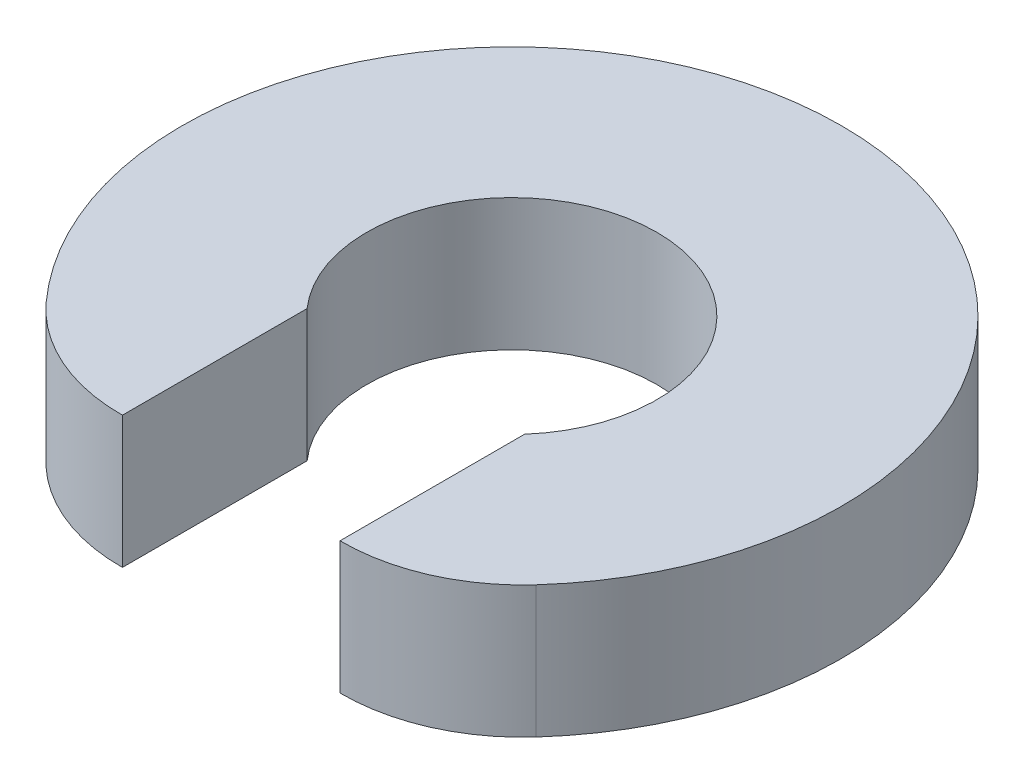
ISO-10303-21;
HEADER;
FILE_DESCRIPTION(('STEP AP214'),'2;1');
FILE_NAME('part.step','',(''),(''),'','','');
FILE_SCHEMA(('AUTOMOTIVE_DESIGN { 1 0 10303 214 1 1 1 1 }'));
ENDSEC;
DATA;
#1=APPLICATION_CONTEXT('core data for automotive mechanical design processes');
#2=APPLICATION_PROTOCOL_DEFINITION('international standard','automotive_design',2000,#1);
#3=PRODUCT_CONTEXT('',#1,'mechanical');
#4=PRODUCT('Part','Part','',(#3));
#5=PRODUCT_RELATED_PRODUCT_CATEGORY('part','',(#4));
#6=PRODUCT_DEFINITION_FORMATION('','',#4);
#7=PRODUCT_DEFINITION_CONTEXT('part definition',#1,'design');
#8=PRODUCT_DEFINITION('design','',#6,#7);
#9=PRODUCT_DEFINITION_SHAPE('','',#8);
#10=(LENGTH_UNIT() NAMED_UNIT(*) SI_UNIT(.MILLI.,.METRE.));
#11=(NAMED_UNIT(*) PLANE_ANGLE_UNIT() SI_UNIT($,.RADIAN.));
#12=(NAMED_UNIT(*) SI_UNIT($,.STERADIAN.) SOLID_ANGLE_UNIT());
#13=UNCERTAINTY_MEASURE_WITH_UNIT(LENGTH_MEASURE(1.E-05),#10,'distance_accuracy_value','');
#14=(GEOMETRIC_REPRESENTATION_CONTEXT(3) GLOBAL_UNCERTAINTY_ASSIGNED_CONTEXT((#13)) GLOBAL_UNIT_ASSIGNED_CONTEXT((#10,
#11,#12)) REPRESENTATION_CONTEXT('',''));
#15=CARTESIAN_POINT('',(0.,0.,0.));
#16=DIRECTION('',(0.,0.,1.));
#17=DIRECTION('',(1.,0.,0.));
#18=AXIS2_PLACEMENT_3D('',#15,#16,#17);
#19=CARTESIAN_POINT('',(0.,0.,0.));
#20=DIRECTION('',(0.,1.,0.));
#21=DIRECTION('',(0.,0.,1.));
#22=AXIS2_PLACEMENT_3D('',#19,#20,#21);
#23=PLANE('',#22);
#24=CARTESIAN_POINT('',(167.207585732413,0.,150.554386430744));
#25=DIRECTION('',(0.,-1.,0.));
#26=DIRECTION('',(0.,0.,-1.));
#27=AXIS2_PLACEMENT_3D('',#24,#25,#26);
#28=CIRCLE('',#27,275.);
#29=CARTESIAN_POINT('',(165.,0.,425.545525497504));
#30=VERTEX_POINT('',#29);
#31=CARTESIAN_POINT('',(371.572412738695,0.,334.565303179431));
#32=VERTEX_POINT('',#31);
#33=EDGE_CURVE('E95',#30,#32,#28,.F.);
#34=ORIENTED_EDGE('',*,*,#33,.F.);
#35=DIRECTION('',(0.,0.,-1.));
#36=VECTOR('',#35,1.);
#37=CARTESIAN_POINT('',(165.,0.,0.));
#38=LINE('',#37,#36);
#39=CARTESIAN_POINT('',(165.,0.,145.516322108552));
#40=VERTEX_POINT('',#39);
#41=EDGE_CURVE('E93',#30,#40,#38,.T.);
#42=ORIENTED_EDGE('',*,*,#41,.T.);
#43=CARTESIAN_POINT('',(0.,0.,0.));
#44=DIRECTION('',(0.,-1.,0.));
#45=DIRECTION('',(0.,0.,-1.));
#46=AXIS2_PLACEMENT_3D('',#43,#44,#45);
#47=CIRCLE('',#46,220.);
#48=CARTESIAN_POINT('',(-165.,0.,145.516322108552));
#49=VERTEX_POINT('',#48);
#50=EDGE_CURVE('E105',#40,#49,#47,.F.);
#51=ORIENTED_EDGE('',*,*,#50,.T.);
#52=DIRECTION('',(0.,0.,-1.));
#53=VECTOR('',#52,1.);
#54=CARTESIAN_POINT('',(-165.,0.,0.));
#55=LINE('',#54,#53);
#56=CARTESIAN_POINT('',(-165.,0.,425.545525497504));
#57=VERTEX_POINT('',#56);
#58=EDGE_CURVE('E72',#57,#49,#55,.T.);
#59=ORIENTED_EDGE('',*,*,#58,.F.);
#60=CARTESIAN_POINT('',(-167.207585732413,0.,150.554386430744));
#61=DIRECTION('',(0.,-1.,0.));
#62=DIRECTION('',(0.,0.,-1.));
#63=AXIS2_PLACEMENT_3D('',#60,#61,#62);
#64=CIRCLE('',#63,275.);
#65=CARTESIAN_POINT('',(-371.572412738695,0.,334.565303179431));
#66=VERTEX_POINT('',#65);
#67=EDGE_CURVE('E68',#66,#57,#64,.F.);
#68=ORIENTED_EDGE('',*,*,#67,.F.);
#69=CARTESIAN_POINT('',(0.,0.,0.));
#70=DIRECTION('',(0.,-1.,0.));
#71=DIRECTION('',(0.,0.,-1.));
#72=AXIS2_PLACEMENT_3D('',#69,#70,#71);
#73=CIRCLE('',#72,500.);
#74=EDGE_CURVE('E20',#32,#66,#73,.F.);
#75=ORIENTED_EDGE('',*,*,#74,.F.);
#76=EDGE_LOOP('',(#34,#42,#51,#59,#68,#75));
#77=FACE_BOUND('',#76,.T.);
#78=ADVANCED_FACE('F17',(#77),#23,.F.);
#79=CARTESIAN_POINT('',(0.,200.,0.));
#80=DIRECTION('',(0.,-1.,0.));
#81=DIRECTION('',(0.,0.,-1.));
#82=AXIS2_PLACEMENT_3D('',#79,#80,#81);
#83=CYLINDRICAL_SURFACE('',#82,500.);
#84=ORIENTED_EDGE('',*,*,#74,.T.);
#85=DIRECTION('',(0.,-1.,0.));
#86=VECTOR('',#85,1.);
#87=CARTESIAN_POINT('',(-371.572412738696,200.,334.565303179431));
#88=LINE('',#87,#86);
#89=CARTESIAN_POINT('',(-371.572412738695,200.,334.565303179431));
#90=VERTEX_POINT('',#89);
#91=EDGE_CURVE('E76',#90,#66,#88,.T.);
#92=ORIENTED_EDGE('',*,*,#91,.F.);
#93=CARTESIAN_POINT('',(0.,200.,0.));
#94=DIRECTION('',(0.,-1.,0.));
#95=DIRECTION('',(0.,0.,-1.));
#96=AXIS2_PLACEMENT_3D('',#93,#94,#95);
#97=CIRCLE('',#96,500.);
#98=CARTESIAN_POINT('',(371.572412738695,200.,334.565303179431));
#99=VERTEX_POINT('',#98);
#100=EDGE_CURVE('E102',#99,#90,#97,.F.);
#101=ORIENTED_EDGE('',*,*,#100,.F.);
#102=DIRECTION('',(0.,-1.,0.));
#103=VECTOR('',#102,1.);
#104=CARTESIAN_POINT('',(371.572412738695,200.,334.565303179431));
#105=LINE('',#104,#103);
#106=EDGE_CURVE('E82',#32,#99,#105,.F.);
#107=ORIENTED_EDGE('',*,*,#106,.F.);
#108=EDGE_LOOP('',(#84,#92,#101,#107));
#109=FACE_BOUND('',#108,.T.);
#110=ADVANCED_FACE('F79',(#109),#83,.T.);
#111=CARTESIAN_POINT('',(-167.207585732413,200.,150.554386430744));
#112=DIRECTION('',(0.,-1.,0.));
#113=DIRECTION('',(0.,0.,-1.));
#114=AXIS2_PLACEMENT_3D('',#111,#112,#113);
#115=CYLINDRICAL_SURFACE('',#114,275.);
#116=CARTESIAN_POINT('',(-167.207585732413,200.,150.554386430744));
#117=DIRECTION('',(0.,-1.,0.));
#118=DIRECTION('',(0.,0.,-1.));
#119=AXIS2_PLACEMENT_3D('',#116,#117,#118);
#120=CIRCLE('',#119,275.);
#121=CARTESIAN_POINT('',(-165.,200.,425.545525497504));
#122=VERTEX_POINT('',#121);
#123=EDGE_CURVE('E86',#90,#122,#120,.F.);
#124=ORIENTED_EDGE('',*,*,#123,.F.);
#125=ORIENTED_EDGE('',*,*,#91,.T.);
#126=ORIENTED_EDGE('',*,*,#67,.T.);
#127=DIRECTION('',(0.,1.,0.));
#128=VECTOR('',#127,1.);
#129=CARTESIAN_POINT('',(-165.,200.,425.545525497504));
#130=LINE('',#129,#128);
#131=EDGE_CURVE('E88',#122,#57,#130,.F.);
#132=ORIENTED_EDGE('',*,*,#131,.F.);
#133=EDGE_LOOP('',(#124,#125,#126,#132));
#134=FACE_BOUND('',#133,.T.);
#135=ADVANCED_FACE('F84',(#134),#115,.T.);
#136=CARTESIAN_POINT('',(-165.,200.,0.));
#137=DIRECTION('',(1.,0.,0.));
#138=DIRECTION('',(0.,0.,-1.));
#139=AXIS2_PLACEMENT_3D('',#136,#137,#138);
#140=PLANE('',#139);
#141=DIRECTION('',(0.,0.,1.));
#142=VECTOR('',#141,1.);
#143=CARTESIAN_POINT('',(-165.,200.,0.));
#144=LINE('',#143,#142);
#145=CARTESIAN_POINT('',(-165.,200.,145.516322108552));
#146=VERTEX_POINT('',#145);
#147=EDGE_CURVE('E100',#122,#146,#144,.F.);
#148=ORIENTED_EDGE('',*,*,#147,.F.);
#149=ORIENTED_EDGE('',*,*,#131,.T.);
#150=ORIENTED_EDGE('',*,*,#58,.T.);
#151=DIRECTION('',(0.,-1.,0.));
#152=VECTOR('',#151,1.);
#153=CARTESIAN_POINT('',(-165.,200.,145.516322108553));
#154=LINE('',#153,#152);
#155=EDGE_CURVE('E106',#49,#146,#154,.F.);
#156=ORIENTED_EDGE('',*,*,#155,.T.);
#157=EDGE_LOOP('',(#148,#149,#150,#156));
#158=FACE_BOUND('',#157,.T.);
#159=ADVANCED_FACE('F139',(#158),#140,.T.);
#160=CARTESIAN_POINT('',(0.,200.,0.));
#161=DIRECTION('',(0.,-1.,0.));
#162=DIRECTION('',(0.,0.,-1.));
#163=AXIS2_PLACEMENT_3D('',#160,#161,#162);
#164=CYLINDRICAL_SURFACE('',#163,220.);
#165=DIRECTION('',(0.,1.,0.));
#166=VECTOR('',#165,1.);
#167=CARTESIAN_POINT('',(165.,200.,145.516322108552));
#168=LINE('',#167,#166);
#169=CARTESIAN_POINT('',(165.,200.,145.516322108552));
#170=VERTEX_POINT('',#169);
#171=EDGE_CURVE('E96',#40,#170,#168,.T.);
#172=ORIENTED_EDGE('',*,*,#171,.T.);
#173=CARTESIAN_POINT('',(0.,200.,0.));
#174=DIRECTION('',(0.,-1.,0.));
#175=DIRECTION('',(0.,0.,-1.));
#176=AXIS2_PLACEMENT_3D('',#173,#174,#175);
#177=CIRCLE('',#176,220.);
#178=EDGE_CURVE('E98',#146,#170,#177,.T.);
#179=ORIENTED_EDGE('',*,*,#178,.F.);
#180=ORIENTED_EDGE('',*,*,#155,.F.);
#181=ORIENTED_EDGE('',*,*,#50,.F.);
#182=EDGE_LOOP('',(#172,#179,#180,#181));
#183=FACE_BOUND('',#182,.T.);
#184=ADVANCED_FACE('F124',(#183),#164,.F.);
#185=CARTESIAN_POINT('',(165.,200.,0.));
#186=DIRECTION('',(1.,0.,0.));
#187=DIRECTION('',(0.,0.,-1.));
#188=AXIS2_PLACEMENT_3D('',#185,#186,#187);
#189=PLANE('',#188);
#190=DIRECTION('',(0.,-1.,0.));
#191=VECTOR('',#190,1.);
#192=CARTESIAN_POINT('',(165.,200.,425.545525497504));
#193=LINE('',#192,#191);
#194=CARTESIAN_POINT('',(165.,200.,425.545525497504));
#195=VERTEX_POINT('',#194);
#196=EDGE_CURVE('E35',#195,#30,#193,.T.);
#197=ORIENTED_EDGE('',*,*,#196,.F.);
#198=DIRECTION('',(0.,0.,1.));
#199=VECTOR('',#198,1.);
#200=CARTESIAN_POINT('',(165.,200.,0.));
#201=LINE('',#200,#199);
#202=EDGE_CURVE('E26',#170,#195,#201,.T.);
#203=ORIENTED_EDGE('',*,*,#202,.F.);
#204=ORIENTED_EDGE('',*,*,#171,.F.);
#205=ORIENTED_EDGE('',*,*,#41,.F.);
#206=EDGE_LOOP('',(#197,#203,#204,#205));
#207=FACE_BOUND('',#206,.T.);
#208=ADVANCED_FACE('F122',(#207),#189,.F.);
#209=CARTESIAN_POINT('',(167.207585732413,200.,150.554386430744));
#210=DIRECTION('',(0.,-1.,0.));
#211=DIRECTION('',(0.,0.,-1.));
#212=AXIS2_PLACEMENT_3D('',#209,#210,#211);
#213=CYLINDRICAL_SURFACE('',#212,275.);
#214=CARTESIAN_POINT('',(167.207585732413,200.,150.554386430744));
#215=DIRECTION('',(0.,-1.,0.));
#216=DIRECTION('',(0.,0.,-1.));
#217=AXIS2_PLACEMENT_3D('',#214,#215,#216);
#218=CIRCLE('',#217,275.);
#219=EDGE_CURVE('E10',#195,#99,#218,.F.);
#220=ORIENTED_EDGE('',*,*,#219,.F.);
#221=ORIENTED_EDGE('',*,*,#196,.T.);
#222=ORIENTED_EDGE('',*,*,#33,.T.);
#223=ORIENTED_EDGE('',*,*,#106,.T.);
#224=EDGE_LOOP('',(#220,#221,#222,#223));
#225=FACE_BOUND('',#224,.T.);
#226=ADVANCED_FACE('F126',(#225),#213,.T.);
#227=CARTESIAN_POINT('',(0.,200.,0.));
#228=DIRECTION('',(0.,1.,0.));
#229=DIRECTION('',(0.,0.,1.));
#230=AXIS2_PLACEMENT_3D('',#227,#228,#229);
#231=PLANE('',#230);
#232=ORIENTED_EDGE('',*,*,#202,.T.);
#233=ORIENTED_EDGE('',*,*,#219,.T.);
#234=ORIENTED_EDGE('',*,*,#100,.T.);
#235=ORIENTED_EDGE('',*,*,#123,.T.);
#236=ORIENTED_EDGE('',*,*,#147,.T.);
#237=ORIENTED_EDGE('',*,*,#178,.T.);
#238=EDGE_LOOP('',(#232,#233,#234,#235,#236,#237));
#239=FACE_BOUND('',#238,.T.);
#240=ADVANCED_FACE('F120',(#239),#231,.T.);
#241=CLOSED_SHELL('',(#78,#110,#135,#159,#184,#208,#226,#240));
#242=MANIFOLD_SOLID_BREP('B1',#241);
#243=ADVANCED_BREP_SHAPE_REPRESENTATION('',(#18,#242),#14);
#244=SHAPE_DEFINITION_REPRESENTATION(#9,#243);
ENDSEC;
END-ISO-10303-21;
